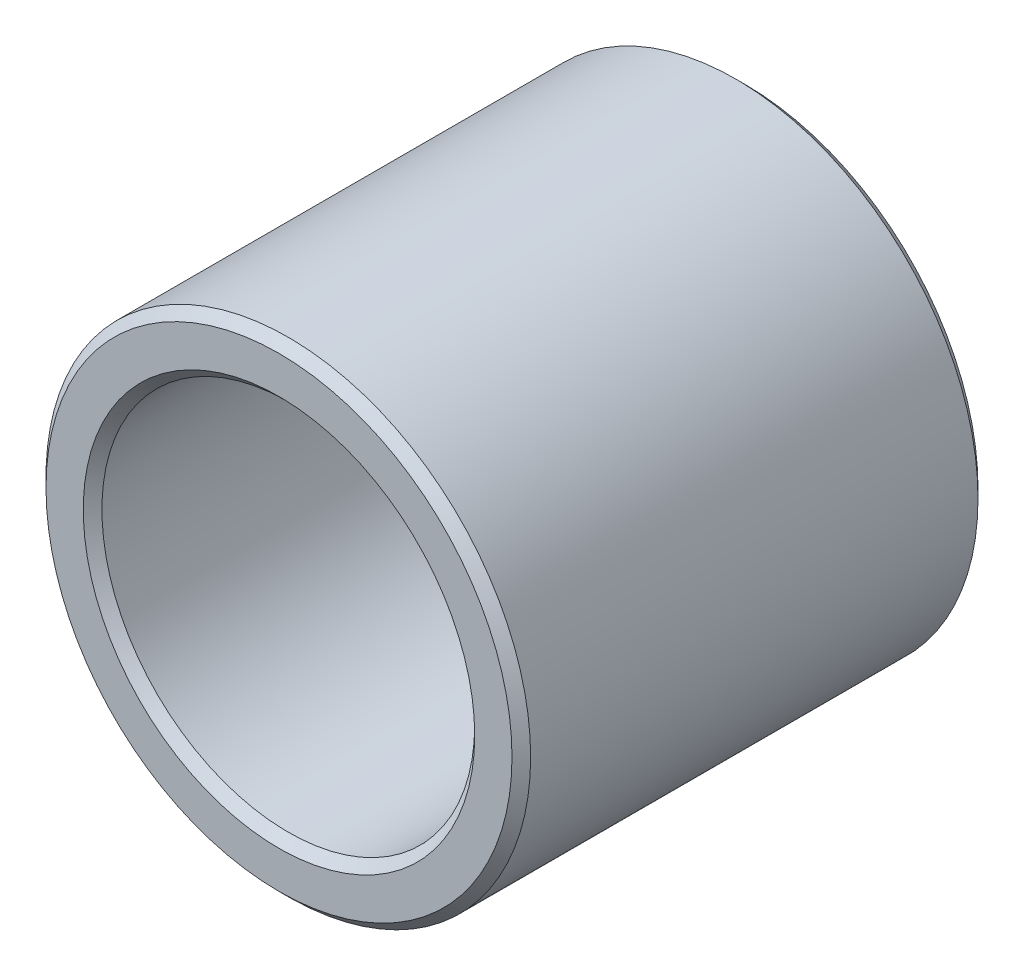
from build123d import *

# Parameters (mm, degrees)
ESQUISSE1_R          = 13
ESQUISSE1_R_2        = 10
BASE_EXTRUSION_DEPTH = 25
CHANFREIN1_SIZE      = 0.5


with BuildPart() as part:
    # Esquisse1 → Base-Extrusion (new body)
    with BuildSketch(Plane.XY):
        Circle(ESQUISSE1_R)
        Circle(ESQUISSE1_R_2, mode=Mode.SUBTRACT)
    extrude(amount=-BASE_EXTRUSION_DEPTH)

    # Chanfrein1
    chanfrein1_edges = [part.edges().sort_by_distance(p)[0] for p in [
        (-13, 0, 0),
        (-13, 0, -25),
        (-10, 0, 0),
        (-10, 0, -25),
    ]]
    chamfer(chanfrein1_edges, length=CHANFREIN1_SIZE)


solid = part.part
